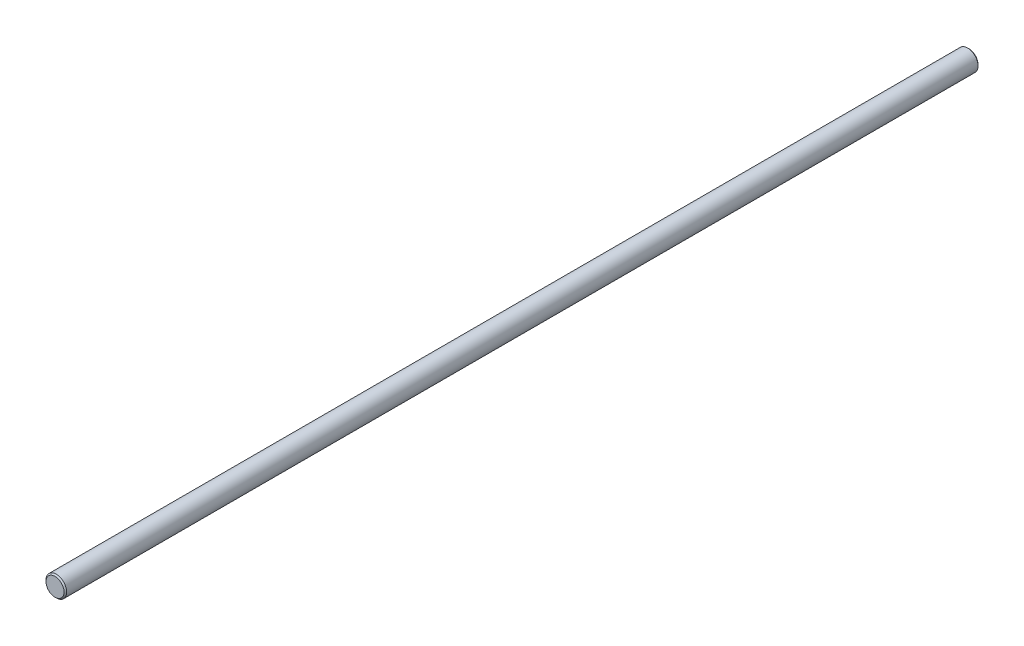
ISO-10303-21;
HEADER;
FILE_DESCRIPTION(('STEP AP214'),'2;1');
FILE_NAME('part.step','',(''),(''),'','','');
FILE_SCHEMA(('AUTOMOTIVE_DESIGN { 1 0 10303 214 1 1 1 1 }'));
ENDSEC;
DATA;
#1=APPLICATION_CONTEXT('core data for automotive mechanical design processes');
#2=APPLICATION_PROTOCOL_DEFINITION('international standard','automotive_design',2000,#1);
#3=PRODUCT_CONTEXT('',#1,'mechanical');
#4=PRODUCT('Part','Part','',(#3));
#5=PRODUCT_RELATED_PRODUCT_CATEGORY('part','',(#4));
#6=PRODUCT_DEFINITION_FORMATION('','',#4);
#7=PRODUCT_DEFINITION_CONTEXT('part definition',#1,'design');
#8=PRODUCT_DEFINITION('design','',#6,#7);
#9=PRODUCT_DEFINITION_SHAPE('','',#8);
#10=(LENGTH_UNIT() NAMED_UNIT(*) SI_UNIT(.MILLI.,.METRE.));
#11=(NAMED_UNIT(*) PLANE_ANGLE_UNIT() SI_UNIT($,.RADIAN.));
#12=(NAMED_UNIT(*) SI_UNIT($,.STERADIAN.) SOLID_ANGLE_UNIT());
#13=UNCERTAINTY_MEASURE_WITH_UNIT(LENGTH_MEASURE(1.E-05),#10,'distance_accuracy_value','');
#14=(GEOMETRIC_REPRESENTATION_CONTEXT(3) GLOBAL_UNCERTAINTY_ASSIGNED_CONTEXT((#13)) GLOBAL_UNIT_ASSIGNED_CONTEXT((#10,
#11,#12)) REPRESENTATION_CONTEXT('',''));
#15=CARTESIAN_POINT('',(0.,0.,0.));
#16=DIRECTION('',(0.,0.,1.));
#17=DIRECTION('',(1.,0.,0.));
#18=AXIS2_PLACEMENT_3D('',#15,#16,#17);
#19=CARTESIAN_POINT('',(0.,0.,177.));
#20=DIRECTION('',(0.,0.,1.));
#21=DIRECTION('',(1.,0.,0.));
#22=AXIS2_PLACEMENT_3D('',#19,#20,#21);
#23=PLANE('',#22);
#24=CARTESIAN_POINT('',(0.,0.,177.));
#25=DIRECTION('',(0.,0.,1.));
#26=DIRECTION('',(1.,0.,0.));
#27=AXIS2_PLACEMENT_3D('',#24,#25,#26);
#28=CIRCLE('',#27,3.5);
#29=CARTESIAN_POINT('',(3.50000000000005,0.,177.));
#30=VERTEX_POINT('',#29);
#31=EDGE_CURVE('E47',#30,#30,#28,.T.);
#32=ORIENTED_EDGE('',*,*,#31,.T.);
#33=EDGE_LOOP('',(#32));
#34=FACE_BOUND('',#33,.T.);
#35=ADVANCED_FACE('F32',(#34),#23,.T.);
#36=CARTESIAN_POINT('',(0.,0.,-177.));
#37=DIRECTION('',(0.,0.,1.));
#38=DIRECTION('',(1.,0.,0.));
#39=AXIS2_PLACEMENT_3D('',#36,#37,#38);
#40=CYLINDRICAL_SURFACE('',#39,4.);
#41=CARTESIAN_POINT('',(0.,0.,176.5));
#42=DIRECTION('',(0.,0.,1.));
#43=DIRECTION('',(1.,0.,0.));
#44=AXIS2_PLACEMENT_3D('',#41,#42,#43);
#45=CIRCLE('',#44,4.);
#46=CARTESIAN_POINT('',(4.00000000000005,0.,176.5));
#47=VERTEX_POINT('',#46);
#48=EDGE_CURVE('E39',#47,#47,#45,.F.);
#49=ORIENTED_EDGE('',*,*,#48,.T.);
#50=EDGE_LOOP('',(#49));
#51=FACE_BOUND('',#50,.T.);
#52=CARTESIAN_POINT('',(0.,0.,-176.5));
#53=DIRECTION('',(0.,0.,-1.));
#54=DIRECTION('',(-1.,0.,0.));
#55=AXIS2_PLACEMENT_3D('',#52,#53,#54);
#56=CIRCLE('',#55,4.);
#57=CARTESIAN_POINT('',(-4.00000000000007,0.,-176.5));
#58=VERTEX_POINT('',#57);
#59=EDGE_CURVE('E43',#58,#58,#56,.F.);
#60=ORIENTED_EDGE('',*,*,#59,.T.);
#61=EDGE_LOOP('',(#60));
#62=FACE_BOUND('',#61,.T.);
#63=ADVANCED_FACE('F63',(#51,#62),#40,.T.);
#64=CARTESIAN_POINT('',(3.99999999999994,0.,-177.));
#65=DIRECTION('',(0.,0.,-1.));
#66=DIRECTION('',(-1.,0.,0.));
#67=AXIS2_PLACEMENT_3D('',#64,#65,#66);
#68=PLANE('',#67);
#69=CARTESIAN_POINT('',(0.,0.,-177.));
#70=DIRECTION('',(0.,0.,-1.));
#71=DIRECTION('',(-1.,0.,0.));
#72=AXIS2_PLACEMENT_3D('',#69,#70,#71);
#73=CIRCLE('',#72,3.50000000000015);
#74=CARTESIAN_POINT('',(-3.50000000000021,0.,-177.));
#75=VERTEX_POINT('',#74);
#76=EDGE_CURVE('E10',#75,#75,#73,.T.);
#77=ORIENTED_EDGE('',*,*,#76,.T.);
#78=EDGE_LOOP('',(#77));
#79=FACE_BOUND('',#78,.T.);
#80=ADVANCED_FACE('F56',(#79),#68,.T.);
#81=CARTESIAN_POINT('',(0.,0.,177.));
#82=DIRECTION('',(0.,0.,-1.));
#83=DIRECTION('',(-1.,0.,0.));
#84=AXIS2_PLACEMENT_3D('',#81,#82,#83);
#85=CONICAL_SURFACE('',#84,3.5,0.785398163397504);
#86=ORIENTED_EDGE('',*,*,#48,.F.);
#87=EDGE_LOOP('',(#86));
#88=FACE_BOUND('',#87,.T.);
#89=ORIENTED_EDGE('',*,*,#31,.F.);
#90=EDGE_LOOP('',(#89));
#91=FACE_BOUND('',#90,.T.);
#92=ADVANCED_FACE('F54',(#88,#91),#85,.T.);
#93=CARTESIAN_POINT('',(0.,0.,-176.5));
#94=DIRECTION('',(0.,0.,1.));
#95=DIRECTION('',(1.,0.,0.));
#96=AXIS2_PLACEMENT_3D('',#93,#94,#95);
#97=CONICAL_SURFACE('',#96,4.,0.785398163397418);
#98=ORIENTED_EDGE('',*,*,#76,.F.);
#99=EDGE_LOOP('',(#98));
#100=FACE_BOUND('',#99,.T.);
#101=ORIENTED_EDGE('',*,*,#59,.F.);
#102=EDGE_LOOP('',(#101));
#103=FACE_BOUND('',#102,.T.);
#104=ADVANCED_FACE('F34',(#100,#103),#97,.T.);
#105=CLOSED_SHELL('',(#35,#63,#80,#92,#104));
#106=MANIFOLD_SOLID_BREP('B2',#105);
#107=ADVANCED_BREP_SHAPE_REPRESENTATION('',(#18,#106),#14);
#108=SHAPE_DEFINITION_REPRESENTATION(#9,#107);
ENDSEC;
END-ISO-10303-21;
